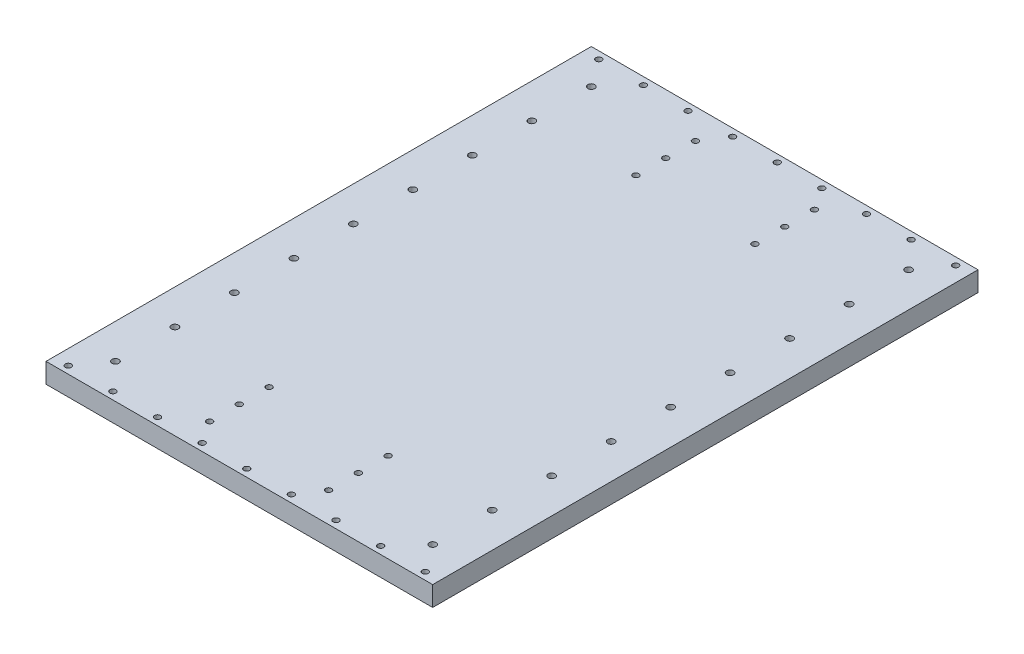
from build123d import *

# Parameters (mm, degrees)
BOSS_EXTRU_1_DEPTH      = 10
BOSS_EXTRU_1_DEPTH_BACK = 10
ESQUISSE1_W             = 390
ESQUISSE1_H             = 550
ESQUISSE1_R             = 3.5
ESQUISSE1_R_2           = 3


with BuildPart() as part:
    # Esquisse1 → Boss.-Extru.1 (new, two sides: drawn at the far end of the back side and taken through both)
    with BuildSketch(Plane(origin=(0, 0, 0), x_dir=(1, 0, 0), z_dir=(0, 1, 0)).offset(-BOSS_EXTRU_1_DEPTH_BACK)):
        Rectangle(ESQUISSE1_W, ESQUISSE1_H)
        with Locations(Location((160, 0, 0), (0, 0, 270))):
            Circle(ESQUISSE1_R, mode=Mode.SUBTRACT)
        with Locations(Location((160, 240, 0), (0, 0, 270))):
            Circle(ESQUISSE1_R, mode=Mode.SUBTRACT)
        with Locations(Location((160, 180, 0), (0, 0, 270))):
            Circle(ESQUISSE1_R, mode=Mode.SUBTRACT)
        with Locations(Location((160, 120, 0), (0, 0, 270))):
            Circle(ESQUISSE1_R, mode=Mode.SUBTRACT)
        with Locations(Location((160, 60, 0), (0, 0, 270))):
            Circle(ESQUISSE1_R, mode=Mode.SUBTRACT)
        with Locations(Location((160, -60, 0), (0, 0, 270))):
            Circle(ESQUISSE1_R, mode=Mode.SUBTRACT)
        with Locations(Location((160, -120, 0), (0, 0, 270))):
            Circle(ESQUISSE1_R, mode=Mode.SUBTRACT)
        with Locations(Location((160, -180, 0), (0, 0, 270))):
            Circle(ESQUISSE1_R, mode=Mode.SUBTRACT)
        with Locations(Location((160, -240, 0), (0, 0, 270))):
            Circle(ESQUISSE1_R, mode=Mode.SUBTRACT)
        with Locations(Location((-160, 240, 0), (0, 0, 270))):
            Circle(ESQUISSE1_R, mode=Mode.SUBTRACT)
        with Locations(Location((-160, 180, 0), (0, 0, 270))):
            Circle(ESQUISSE1_R, mode=Mode.SUBTRACT)
        with Locations(Location((-160, 120, 0), (0, 0, 270))):
            Circle(ESQUISSE1_R, mode=Mode.SUBTRACT)
        with Locations(Location((-160, 60, 0), (0, 0, 270))):
            Circle(ESQUISSE1_R, mode=Mode.SUBTRACT)
        with Locations(Location((-160, 0, 0), (0, 0, 270))):
            Circle(ESQUISSE1_R, mode=Mode.SUBTRACT)
        with Locations(Location((-160, -60, 0), (0, 0, 270))):
            Circle(ESQUISSE1_R, mode=Mode.SUBTRACT)
        with Locations(Location((-160, -120, 0), (0, 0, 270))):
            Circle(ESQUISSE1_R, mode=Mode.SUBTRACT)
        with Locations(Location((-160, -180, 0), (0, 0, 270))):
            Circle(ESQUISSE1_R, mode=Mode.SUBTRACT)
        with Locations(Location((-160, -240, 0), (0, 0, 270))):
            Circle(ESQUISSE1_R, mode=Mode.SUBTRACT)
        with Locations(Location((-180, -267.5, 0), (0, 0, 270))):
            Circle(ESQUISSE1_R_2, mode=Mode.SUBTRACT)
        with Locations(Location((-135, -267.5, 0), (0, 0, 270))):
            Circle(ESQUISSE1_R_2, mode=Mode.SUBTRACT)
        with Locations(Location((-90, -267.5, 0), (0, 0, 270))):
            Circle(ESQUISSE1_R_2, mode=Mode.SUBTRACT)
        with Locations(Location((-45, -267.5, 0), (0, 0, 270))):
            Circle(ESQUISSE1_R_2, mode=Mode.SUBTRACT)
        with Locations(Location((0, -267.5, 0), (0, 0, 270))):
            Circle(ESQUISSE1_R_2, mode=Mode.SUBTRACT)
        with Locations(Location((45, -267.5, 0), (0, 0, 270))):
            Circle(ESQUISSE1_R_2, mode=Mode.SUBTRACT)
        with Locations(Location((90, -267.5, 0), (0, 0, 270))):
            Circle(ESQUISSE1_R_2, mode=Mode.SUBTRACT)
        with Locations(Location((135, -267.5, 0), (0, 0, 270))):
            Circle(ESQUISSE1_R_2, mode=Mode.SUBTRACT)
        with Locations(Location((180, -267.5, 0), (0, 0, 270))):
            Circle(ESQUISSE1_R_2, mode=Mode.SUBTRACT)
        with Locations(Location((0, 267.5, 0), (0, 0, 270))):
            Circle(ESQUISSE1_R_2, mode=Mode.SUBTRACT)
        with Locations(Location((-180, 267.5, 0), (0, 0, 270))):
            Circle(ESQUISSE1_R_2, mode=Mode.SUBTRACT)
        with Locations(Location((-135, 267.5, 0), (0, 0, 270))):
            Circle(ESQUISSE1_R_2, mode=Mode.SUBTRACT)
        with Locations(Location((-90, 267.5, 0), (0, 0, 270))):
            Circle(ESQUISSE1_R_2, mode=Mode.SUBTRACT)
        with Locations(Location((-45, 267.5, 0), (0, 0, 270))):
            Circle(ESQUISSE1_R_2, mode=Mode.SUBTRACT)
        with Locations(Location((45, 267.5, 0), (0, 0, 270))):
            Circle(ESQUISSE1_R_2, mode=Mode.SUBTRACT)
        with Locations(Location((90, 267.5, 0), (0, 0, 270))):
            Circle(ESQUISSE1_R_2, mode=Mode.SUBTRACT)
        with Locations(Location((135, 267.5, 0), (0, 0, 270))):
            Circle(ESQUISSE1_R_2, mode=Mode.SUBTRACT)
        with Locations(Location((180, 267.5, 0), (0, 0, 270))):
            Circle(ESQUISSE1_R_2, mode=Mode.SUBTRACT)
        with Locations(Location((-60, 245, 0), (0, 0, 270))):
            Circle(ESQUISSE1_R_2, mode=Mode.SUBTRACT)
        with Locations(Location((-60, 215, 0), (0, 0, 270))):
            Circle(ESQUISSE1_R_2, mode=Mode.SUBTRACT)
        with Locations(Location((-60, 185, 0), (0, 0, 270))):
            Circle(ESQUISSE1_R_2, mode=Mode.SUBTRACT)
        with Locations(Location((-60, -245, 0), (0, 0, 270))):
            Circle(ESQUISSE1_R_2, mode=Mode.SUBTRACT)
        with Locations(Location((-60, -215, 0), (0, 0, 270))):
            Circle(ESQUISSE1_R_2, mode=Mode.SUBTRACT)
        with Locations(Location((-60, -185, 0), (0, 0, 270))):
            Circle(ESQUISSE1_R_2, mode=Mode.SUBTRACT)
        with Locations(Location((60, -185, 0), (0, 0, 270))):
            Circle(ESQUISSE1_R_2, mode=Mode.SUBTRACT)
        with Locations(Location((60, -215, 0), (0, 0, 270))):
            Circle(ESQUISSE1_R_2, mode=Mode.SUBTRACT)
        with Locations(Location((60, -245, 0), (0, 0, 270))):
            Circle(ESQUISSE1_R_2, mode=Mode.SUBTRACT)
        with Locations(Location((60, 245, 0), (0, 0, 270))):
            Circle(ESQUISSE1_R_2, mode=Mode.SUBTRACT)
        with Locations(Location((60, 215, 0), (0, 0, 270))):
            Circle(ESQUISSE1_R_2, mode=Mode.SUBTRACT)
        with Locations(Location((60, 185, 0), (0, 0, 270))):
            Circle(ESQUISSE1_R_2, mode=Mode.SUBTRACT)
    extrude(amount=BOSS_EXTRU_1_DEPTH + BOSS_EXTRU_1_DEPTH_BACK)


solid = part.part
